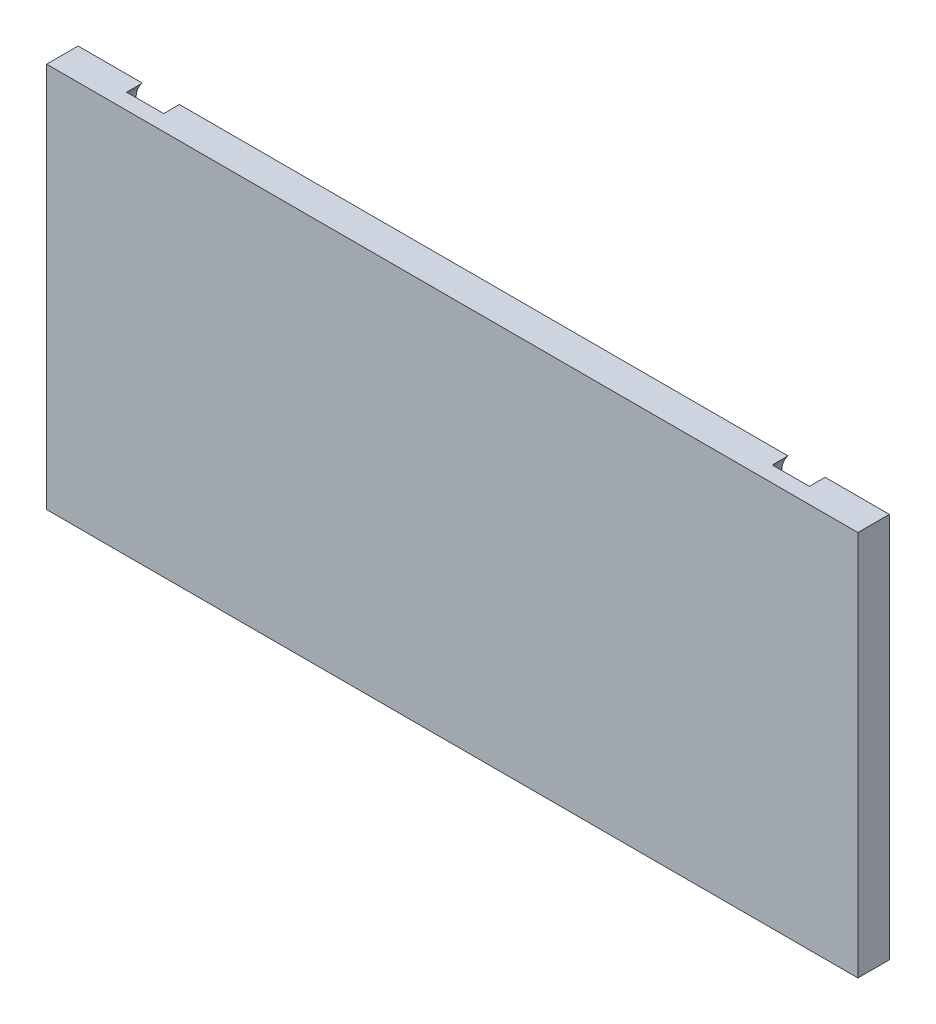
from build123d import *

# Parameters (mm, degrees)
ESQUISSE1_W             = 490
ESQUISSE1_H             = 233
BOSS_EXTRU_1_DEPTH      = 19
ESQUISSE2_R             = 15
ENL_V_MAT_EXTRU_1_DEPTH = 9.5


with BuildPart() as part:
    # Esquisse1 → Boss.-Extru.1 (new body)
    with BuildSketch(Plane.XY):
        Rectangle(ESQUISSE1_W, ESQUISSE1_H)
    extrude(amount=BOSS_EXTRU_1_DEPTH)

    # Esquisse2 → Enl_v. mat.-Extru.1 (cut)
    with BuildSketch(Plane(origin=(0, 0, 0), x_dir=(-1, 0, 0), z_dir=(0, 0, -1))):
        with Locations((-195, -106.5)):
            Circle(ESQUISSE2_R)
        with Locations((195, -106.5)):
            Circle(ESQUISSE2_R)
        with Locations((195, 106.5)):
            Circle(ESQUISSE2_R)
        with Locations((-195, 106.5)):
            Circle(ESQUISSE2_R)
    extrude(amount=-ENL_V_MAT_EXTRU_1_DEPTH, mode=Mode.SUBTRACT)


solid = part.part
